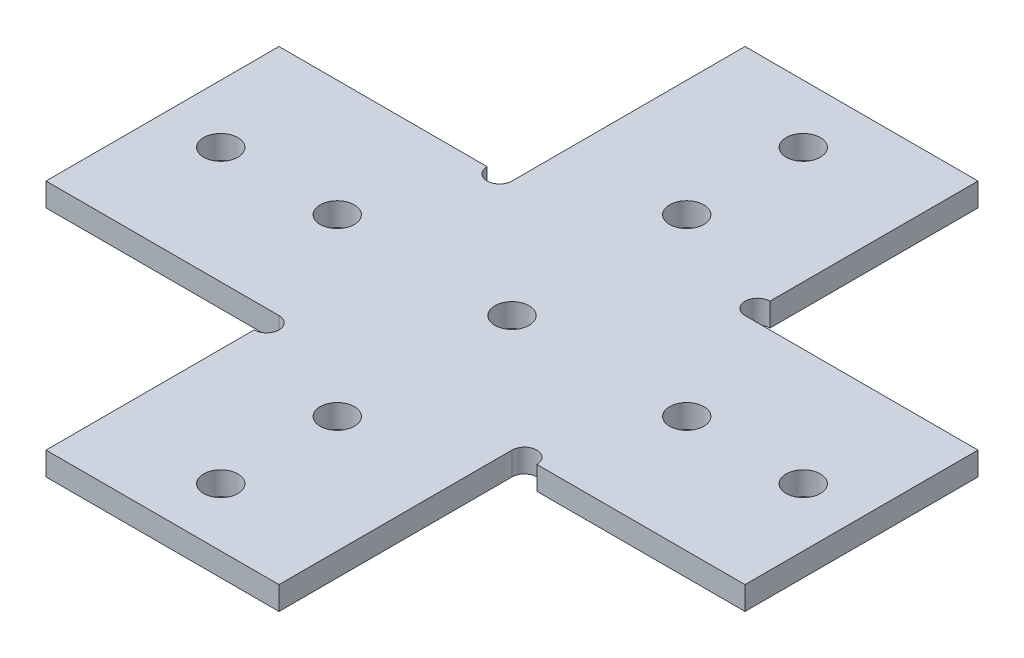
ISO-10303-21;
HEADER;
FILE_DESCRIPTION(('STEP AP214'),'2;1');
FILE_NAME('part.step','',(''),(''),'','','');
FILE_SCHEMA(('AUTOMOTIVE_DESIGN { 1 0 10303 214 1 1 1 1 }'));
ENDSEC;
DATA;
#1=APPLICATION_CONTEXT('core data for automotive mechanical design processes');
#2=APPLICATION_PROTOCOL_DEFINITION('international standard','automotive_design',2000,#1);
#3=PRODUCT_CONTEXT('',#1,'mechanical');
#4=PRODUCT('Part','Part','',(#3));
#5=PRODUCT_RELATED_PRODUCT_CATEGORY('part','',(#4));
#6=PRODUCT_DEFINITION_FORMATION('','',#4);
#7=PRODUCT_DEFINITION_CONTEXT('part definition',#1,'design');
#8=PRODUCT_DEFINITION('design','',#6,#7);
#9=PRODUCT_DEFINITION_SHAPE('','',#8);
#10=(LENGTH_UNIT() NAMED_UNIT(*) SI_UNIT(.MILLI.,.METRE.));
#11=(NAMED_UNIT(*) PLANE_ANGLE_UNIT() SI_UNIT($,.RADIAN.));
#12=(NAMED_UNIT(*) SI_UNIT($,.STERADIAN.) SOLID_ANGLE_UNIT());
#13=UNCERTAINTY_MEASURE_WITH_UNIT(LENGTH_MEASURE(1.E-05),#10,'distance_accuracy_value','');
#14=(GEOMETRIC_REPRESENTATION_CONTEXT(3) GLOBAL_UNCERTAINTY_ASSIGNED_CONTEXT((#13)) GLOBAL_UNIT_ASSIGNED_CONTEXT((#10,
#11,#12)) REPRESENTATION_CONTEXT('',''));
#15=CARTESIAN_POINT('',(0.,0.,0.));
#16=DIRECTION('',(0.,0.,1.));
#17=DIRECTION('',(1.,0.,0.));
#18=AXIS2_PLACEMENT_3D('',#15,#16,#17);
#19=CARTESIAN_POINT('',(-15.,-1.,16.6));
#20=DIRECTION('',(0.,1.,0.));
#21=DIRECTION('',(0.,0.,1.));
#22=AXIS2_PLACEMENT_3D('',#19,#20,#21);
#23=CYLINDRICAL_SURFACE('',#22,1.6);
#24=DIRECTION('',(0.,1.,0.));
#25=VECTOR('',#24,1.);
#26=CARTESIAN_POINT('',(-15.,-1.,18.2));
#27=LINE('',#26,#25);
#28=CARTESIAN_POINT('',(-15.,0.,18.2));
#29=VERTEX_POINT('',#28);
#30=CARTESIAN_POINT('',(-15.,3.,18.2));
#31=VERTEX_POINT('',#30);
#32=EDGE_CURVE('E177',#29,#31,#27,.T.);
#33=ORIENTED_EDGE('',*,*,#32,.T.);
#34=CARTESIAN_POINT('',(-15.,3.,16.6));
#35=DIRECTION('',(0.,1.,0.));
#36=DIRECTION('',(0.,0.,1.));
#37=AXIS2_PLACEMENT_3D('',#34,#35,#36);
#38=CIRCLE('',#37,1.6);
#39=CARTESIAN_POINT('',(-15.,3.,15.));
#40=VERTEX_POINT('',#39);
#41=EDGE_CURVE('E171',#31,#40,#38,.T.);
#42=ORIENTED_EDGE('',*,*,#41,.T.);
#43=DIRECTION('',(0.,-1.,0.));
#44=VECTOR('',#43,1.);
#45=CARTESIAN_POINT('',(-15.,3.,15.));
#46=LINE('',#45,#44);
#47=CARTESIAN_POINT('',(-15.,0.,15.));
#48=VERTEX_POINT('',#47);
#49=EDGE_CURVE('E174',#40,#48,#46,.T.);
#50=ORIENTED_EDGE('',*,*,#49,.T.);
#51=CARTESIAN_POINT('',(-15.,0.,16.6));
#52=DIRECTION('',(0.,1.,0.));
#53=DIRECTION('',(0.,0.,1.));
#54=AXIS2_PLACEMENT_3D('',#51,#52,#53);
#55=CIRCLE('',#54,1.6);
#56=EDGE_CURVE('E11',#29,#48,#55,.T.);
#57=ORIENTED_EDGE('',*,*,#56,.F.);
#58=EDGE_LOOP('',(#33,#42,#50,#57));
#59=FACE_BOUND('',#58,.T.);
#60=ADVANCED_FACE('F17',(#59),#23,.F.);
#61=CARTESIAN_POINT('',(16.6,-1.,15.));
#62=DIRECTION('',(0.,1.,0.));
#63=DIRECTION('',(0.,0.,1.));
#64=AXIS2_PLACEMENT_3D('',#61,#62,#63);
#65=CYLINDRICAL_SURFACE('',#64,1.6);
#66=CARTESIAN_POINT('',(16.6,0.,15.));
#67=DIRECTION('',(0.,1.,0.));
#68=DIRECTION('',(0.,0.,1.));
#69=AXIS2_PLACEMENT_3D('',#66,#67,#68);
#70=CIRCLE('',#69,1.6);
#71=CARTESIAN_POINT('',(18.2,0.,15.));
#72=VERTEX_POINT('',#71);
#73=CARTESIAN_POINT('',(15.,0.,15.));
#74=VERTEX_POINT('',#73);
#75=EDGE_CURVE('E25',#72,#74,#70,.T.);
#76=ORIENTED_EDGE('',*,*,#75,.F.);
#77=DIRECTION('',(0.,-1.,0.));
#78=VECTOR('',#77,1.);
#79=CARTESIAN_POINT('',(18.2,-1.,15.));
#80=LINE('',#79,#78);
#81=CARTESIAN_POINT('',(18.2,3.,15.));
#82=VERTEX_POINT('',#81);
#83=EDGE_CURVE('E242',#82,#72,#80,.T.);
#84=ORIENTED_EDGE('',*,*,#83,.F.);
#85=CARTESIAN_POINT('',(16.6,3.,15.));
#86=DIRECTION('',(0.,1.,0.));
#87=DIRECTION('',(0.,0.,1.));
#88=AXIS2_PLACEMENT_3D('',#85,#86,#87);
#89=CIRCLE('',#88,1.6);
#90=CARTESIAN_POINT('',(15.,3.,15.));
#91=VERTEX_POINT('',#90);
#92=EDGE_CURVE('E182',#82,#91,#89,.T.);
#93=ORIENTED_EDGE('',*,*,#92,.T.);
#94=DIRECTION('',(0.,-1.,0.));
#95=VECTOR('',#94,1.);
#96=CARTESIAN_POINT('',(15.,3.,15.));
#97=LINE('',#96,#95);
#98=EDGE_CURVE('E237',#91,#74,#97,.T.);
#99=ORIENTED_EDGE('',*,*,#98,.T.);
#100=EDGE_LOOP('',(#76,#84,#93,#99));
#101=FACE_BOUND('',#100,.T.);
#102=ADVANCED_FACE('F297',(#101),#65,.F.);
#103=CARTESIAN_POINT('',(15.,-1.,-16.6));
#104=DIRECTION('',(0.,1.,0.));
#105=DIRECTION('',(0.,0.,1.));
#106=AXIS2_PLACEMENT_3D('',#103,#104,#105);
#107=CYLINDRICAL_SURFACE('',#106,1.6);
#108=CARTESIAN_POINT('',(15.,0.,-16.6));
#109=DIRECTION('',(0.,1.,0.));
#110=DIRECTION('',(0.,0.,1.));
#111=AXIS2_PLACEMENT_3D('',#108,#109,#110);
#112=CIRCLE('',#111,1.6);
#113=CARTESIAN_POINT('',(15.,0.,-18.2));
#114=VERTEX_POINT('',#113);
#115=CARTESIAN_POINT('',(15.,0.,-15.));
#116=VERTEX_POINT('',#115);
#117=EDGE_CURVE('E49',#114,#116,#112,.T.);
#118=ORIENTED_EDGE('',*,*,#117,.F.);
#119=DIRECTION('',(0.,-1.,0.));
#120=VECTOR('',#119,1.);
#121=CARTESIAN_POINT('',(15.,-1.,-18.2));
#122=LINE('',#121,#120);
#123=CARTESIAN_POINT('',(15.,3.,-18.2));
#124=VERTEX_POINT('',#123);
#125=EDGE_CURVE('E274',#124,#114,#122,.T.);
#126=ORIENTED_EDGE('',*,*,#125,.F.);
#127=CARTESIAN_POINT('',(15.,3.,-16.6));
#128=DIRECTION('',(0.,1.,0.));
#129=DIRECTION('',(0.,0.,1.));
#130=AXIS2_PLACEMENT_3D('',#127,#128,#129);
#131=CIRCLE('',#130,1.6);
#132=CARTESIAN_POINT('',(15.,3.,-15.));
#133=VERTEX_POINT('',#132);
#134=EDGE_CURVE('E233',#124,#133,#131,.T.);
#135=ORIENTED_EDGE('',*,*,#134,.T.);
#136=DIRECTION('',(0.,-1.,0.));
#137=VECTOR('',#136,1.);
#138=CARTESIAN_POINT('',(15.,3.,-15.));
#139=LINE('',#138,#137);
#140=EDGE_CURVE('E263',#133,#116,#139,.T.);
#141=ORIENTED_EDGE('',*,*,#140,.T.);
#142=EDGE_LOOP('',(#118,#126,#135,#141));
#143=FACE_BOUND('',#142,.T.);
#144=ADVANCED_FACE('F379',(#143),#107,.F.);
#145=CARTESIAN_POINT('',(0.,0.,0.));
#146=DIRECTION('',(0.,1.,0.));
#147=DIRECTION('',(1.,0.,0.));
#148=AXIS2_PLACEMENT_3D('',#145,#146,#147);
#149=PLANE('',#148);
#150=CARTESIAN_POINT('',(0.,0.,22.5));
#151=DIRECTION('',(0.,1.,0.));
#152=DIRECTION('',(0.,0.,1.));
#153=AXIS2_PLACEMENT_3D('',#150,#151,#152);
#154=CIRCLE('',#153,2.2);
#155=CARTESIAN_POINT('',(0.,0.,24.7));
#156=VERTEX_POINT('',#155);
#157=EDGE_CURVE('E428',#156,#156,#154,.T.);
#158=ORIENTED_EDGE('',*,*,#157,.T.);
#159=EDGE_LOOP('',(#158));
#160=FACE_BOUND('',#159,.T.);
#161=CARTESIAN_POINT('',(0.,0.,37.5));
#162=DIRECTION('',(0.,1.,0.));
#163=DIRECTION('',(0.,0.,1.));
#164=AXIS2_PLACEMENT_3D('',#161,#162,#163);
#165=CIRCLE('',#164,2.2);
#166=CARTESIAN_POINT('',(0.,0.,39.7));
#167=VERTEX_POINT('',#166);
#168=EDGE_CURVE('E332',#167,#167,#165,.T.);
#169=ORIENTED_EDGE('',*,*,#168,.T.);
#170=EDGE_LOOP('',(#169));
#171=FACE_BOUND('',#170,.T.);
#172=CARTESIAN_POINT('',(37.5,0.,0.));
#173=DIRECTION('',(0.,-1.,0.));
#174=DIRECTION('',(0.,0.,1.));
#175=AXIS2_PLACEMENT_3D('',#172,#173,#174);
#176=CIRCLE('',#175,2.2);
#177=CARTESIAN_POINT('',(37.5,0.,2.2));
#178=VERTEX_POINT('',#177);
#179=EDGE_CURVE('E323',#178,#178,#176,.T.);
#180=ORIENTED_EDGE('',*,*,#179,.F.);
#181=EDGE_LOOP('',(#180));
#182=FACE_BOUND('',#181,.T.);
#183=CARTESIAN_POINT('',(22.5,0.,0.));
#184=DIRECTION('',(0.,-1.,0.));
#185=DIRECTION('',(0.,0.,1.));
#186=AXIS2_PLACEMENT_3D('',#183,#184,#185);
#187=CIRCLE('',#186,2.2);
#188=CARTESIAN_POINT('',(22.5,0.,2.2));
#189=VERTEX_POINT('',#188);
#190=EDGE_CURVE('E324',#189,#189,#187,.T.);
#191=ORIENTED_EDGE('',*,*,#190,.F.);
#192=EDGE_LOOP('',(#191));
#193=FACE_BOUND('',#192,.T.);
#194=CARTESIAN_POINT('',(-22.5,0.,0.));
#195=DIRECTION('',(0.,1.,0.));
#196=DIRECTION('',(0.,0.,1.));
#197=AXIS2_PLACEMENT_3D('',#194,#195,#196);
#198=CIRCLE('',#197,2.2);
#199=CARTESIAN_POINT('',(-22.5,0.,2.2));
#200=VERTEX_POINT('',#199);
#201=EDGE_CURVE('E462',#200,#200,#198,.T.);
#202=ORIENTED_EDGE('',*,*,#201,.T.);
#203=EDGE_LOOP('',(#202));
#204=FACE_BOUND('',#203,.T.);
#205=CARTESIAN_POINT('',(-37.5,0.,0.));
#206=DIRECTION('',(0.,1.,0.));
#207=DIRECTION('',(0.,0.,1.));
#208=AXIS2_PLACEMENT_3D('',#205,#206,#207);
#209=CIRCLE('',#208,2.2);
#210=CARTESIAN_POINT('',(-37.5,0.,2.2));
#211=VERTEX_POINT('',#210);
#212=EDGE_CURVE('E452',#211,#211,#209,.T.);
#213=ORIENTED_EDGE('',*,*,#212,.T.);
#214=EDGE_LOOP('',(#213));
#215=FACE_BOUND('',#214,.T.);
#216=CARTESIAN_POINT('',(0.,0.,0.));
#217=DIRECTION('',(0.,1.,0.));
#218=DIRECTION('',(0.,0.,1.));
#219=AXIS2_PLACEMENT_3D('',#216,#217,#218);
#220=CIRCLE('',#219,2.2);
#221=CARTESIAN_POINT('',(0.,0.,2.2));
#222=VERTEX_POINT('',#221);
#223=EDGE_CURVE('E439',#222,#222,#220,.T.);
#224=ORIENTED_EDGE('',*,*,#223,.T.);
#225=EDGE_LOOP('',(#224));
#226=FACE_BOUND('',#225,.T.);
#227=CARTESIAN_POINT('',(0.,0.,-22.5));
#228=DIRECTION('',(0.,-1.,0.));
#229=DIRECTION('',(0.,0.,1.));
#230=AXIS2_PLACEMENT_3D('',#227,#228,#229);
#231=CIRCLE('',#230,2.2);
#232=CARTESIAN_POINT('',(0.,0.,-20.3));
#233=VERTEX_POINT('',#232);
#234=EDGE_CURVE('E420',#233,#233,#231,.T.);
#235=ORIENTED_EDGE('',*,*,#234,.F.);
#236=EDGE_LOOP('',(#235));
#237=FACE_BOUND('',#236,.T.);
#238=CARTESIAN_POINT('',(0.,0.,-37.5));
#239=DIRECTION('',(0.,-1.,0.));
#240=DIRECTION('',(0.,0.,1.));
#241=AXIS2_PLACEMENT_3D('',#238,#239,#240);
#242=CIRCLE('',#241,2.2);
#243=CARTESIAN_POINT('',(0.,0.,-35.3));
#244=VERTEX_POINT('',#243);
#245=EDGE_CURVE('E435',#244,#244,#242,.T.);
#246=ORIENTED_EDGE('',*,*,#245,.F.);
#247=EDGE_LOOP('',(#246));
#248=FACE_BOUND('',#247,.T.);
#249=DIRECTION('',(1.,0.,0.));
#250=VECTOR('',#249,1.);
#251=CARTESIAN_POINT('',(0.,0.,-15.));
#252=LINE('',#251,#250);
#253=CARTESIAN_POINT('',(-45.,0.,-15.));
#254=VERTEX_POINT('',#253);
#255=CARTESIAN_POINT('',(-18.2,0.,-15.));
#256=VERTEX_POINT('',#255);
#257=EDGE_CURVE('E349',#254,#256,#252,.T.);
#258=ORIENTED_EDGE('',*,*,#257,.T.);
#259=CARTESIAN_POINT('',(-16.6,0.,-15.));
#260=DIRECTION('',(0.,1.,0.));
#261=DIRECTION('',(0.,0.,1.));
#262=AXIS2_PLACEMENT_3D('',#259,#260,#261);
#263=CIRCLE('',#262,1.6);
#264=CARTESIAN_POINT('',(-15.,0.,-15.));
#265=VERTEX_POINT('',#264);
#266=EDGE_CURVE('E403',#256,#265,#263,.T.);
#267=ORIENTED_EDGE('',*,*,#266,.T.);
#268=DIRECTION('',(0.,0.,-1.));
#269=VECTOR('',#268,1.);
#270=CARTESIAN_POINT('',(-15.,0.,0.));
#271=LINE('',#270,#269);
#272=CARTESIAN_POINT('',(-15.,0.,-45.));
#273=VERTEX_POINT('',#272);
#274=EDGE_CURVE('E336',#265,#273,#271,.T.);
#275=ORIENTED_EDGE('',*,*,#274,.T.);
#276=DIRECTION('',(1.,0.,0.));
#277=VECTOR('',#276,1.);
#278=CARTESIAN_POINT('',(0.,0.,-45.));
#279=LINE('',#278,#277);
#280=CARTESIAN_POINT('',(15.,0.,-45.));
#281=VERTEX_POINT('',#280);
#282=EDGE_CURVE('E38',#273,#281,#279,.T.);
#283=ORIENTED_EDGE('',*,*,#282,.T.);
#284=DIRECTION('',(0.,0.,-1.));
#285=VECTOR('',#284,1.);
#286=CARTESIAN_POINT('',(15.,0.,0.));
#287=LINE('',#286,#285);
#288=EDGE_CURVE('E275',#114,#281,#287,.T.);
#289=ORIENTED_EDGE('',*,*,#288,.F.);
#290=ORIENTED_EDGE('',*,*,#117,.T.);
#291=DIRECTION('',(1.,0.,0.));
#292=VECTOR('',#291,1.);
#293=CARTESIAN_POINT('',(0.,0.,-15.));
#294=LINE('',#293,#292);
#295=CARTESIAN_POINT('',(45.,0.,-15.));
#296=VERTEX_POINT('',#295);
#297=EDGE_CURVE('E260',#116,#296,#294,.T.);
#298=ORIENTED_EDGE('',*,*,#297,.T.);
#299=DIRECTION('',(0.,0.,-1.));
#300=VECTOR('',#299,1.);
#301=CARTESIAN_POINT('',(45.,0.,0.));
#302=LINE('',#301,#300);
#303=CARTESIAN_POINT('',(45.,0.,15.));
#304=VERTEX_POINT('',#303);
#305=EDGE_CURVE('E247',#304,#296,#302,.T.);
#306=ORIENTED_EDGE('',*,*,#305,.F.);
#307=DIRECTION('',(1.,0.,0.));
#308=VECTOR('',#307,1.);
#309=CARTESIAN_POINT('',(0.,0.,15.));
#310=LINE('',#309,#308);
#311=EDGE_CURVE('E205',#72,#304,#310,.T.);
#312=ORIENTED_EDGE('',*,*,#311,.F.);
#313=ORIENTED_EDGE('',*,*,#75,.T.);
#314=DIRECTION('',(0.,0.,-1.));
#315=VECTOR('',#314,1.);
#316=CARTESIAN_POINT('',(15.,0.,0.));
#317=LINE('',#316,#315);
#318=CARTESIAN_POINT('',(15.,0.,45.));
#319=VERTEX_POINT('',#318);
#320=EDGE_CURVE('E230',#319,#74,#317,.T.);
#321=ORIENTED_EDGE('',*,*,#320,.F.);
#322=DIRECTION('',(1.,0.,0.));
#323=VECTOR('',#322,1.);
#324=CARTESIAN_POINT('',(0.,0.,45.));
#325=LINE('',#324,#323);
#326=CARTESIAN_POINT('',(-15.,0.,45.));
#327=VERTEX_POINT('',#326);
#328=EDGE_CURVE('E215',#327,#319,#325,.T.);
#329=ORIENTED_EDGE('',*,*,#328,.F.);
#330=DIRECTION('',(0.,0.,-1.));
#331=VECTOR('',#330,1.);
#332=CARTESIAN_POINT('',(-15.,0.,0.));
#333=LINE('',#332,#331);
#334=EDGE_CURVE('E210',#327,#29,#333,.T.);
#335=ORIENTED_EDGE('',*,*,#334,.T.);
#336=ORIENTED_EDGE('',*,*,#56,.T.);
#337=DIRECTION('',(1.,0.,0.));
#338=VECTOR('',#337,1.);
#339=CARTESIAN_POINT('',(0.,0.,15.));
#340=LINE('',#339,#338);
#341=CARTESIAN_POINT('',(-45.,0.,15.));
#342=VERTEX_POINT('',#341);
#343=EDGE_CURVE('E196',#342,#48,#340,.T.);
#344=ORIENTED_EDGE('',*,*,#343,.F.);
#345=DIRECTION('',(0.,0.,-1.));
#346=VECTOR('',#345,1.);
#347=CARTESIAN_POINT('',(-45.,0.,0.));
#348=LINE('',#347,#346);
#349=EDGE_CURVE('E352',#342,#254,#348,.T.);
#350=ORIENTED_EDGE('',*,*,#349,.T.);
#351=EDGE_LOOP('',(#258,#267,#275,#283,#289,#290,#298,#306,#312,#313,#321,#329,#335,#336,#344,#350));
#352=FACE_BOUND('',#351,.T.);
#353=ADVANCED_FACE('F291',(#160,#171,#182,#193,#204,#215,#226,#237,#248,#352),#149,.F.);
#354=CARTESIAN_POINT('',(0.,3.,0.));
#355=DIRECTION('',(0.,1.,0.));
#356=DIRECTION('',(1.,0.,0.));
#357=AXIS2_PLACEMENT_3D('',#354,#355,#356);
#358=PLANE('',#357);
#359=CARTESIAN_POINT('',(0.,3.,22.5));
#360=DIRECTION('',(0.,1.,0.));
#361=DIRECTION('',(0.,0.,1.));
#362=AXIS2_PLACEMENT_3D('',#359,#360,#361);
#363=CIRCLE('',#362,2.2);
#364=CARTESIAN_POINT('',(0.,3.,24.7));
#365=VERTEX_POINT('',#364);
#366=EDGE_CURVE('E419',#365,#365,#363,.T.);
#367=ORIENTED_EDGE('',*,*,#366,.F.);
#368=EDGE_LOOP('',(#367));
#369=FACE_BOUND('',#368,.T.);
#370=CARTESIAN_POINT('',(0.,3.,37.5));
#371=DIRECTION('',(0.,1.,0.));
#372=DIRECTION('',(0.,0.,1.));
#373=AXIS2_PLACEMENT_3D('',#370,#371,#372);
#374=CIRCLE('',#373,2.2);
#375=CARTESIAN_POINT('',(0.,3.,39.7));
#376=VERTEX_POINT('',#375);
#377=EDGE_CURVE('E328',#376,#376,#374,.T.);
#378=ORIENTED_EDGE('',*,*,#377,.F.);
#379=EDGE_LOOP('',(#378));
#380=FACE_BOUND('',#379,.T.);
#381=CARTESIAN_POINT('',(37.5,3.,0.));
#382=DIRECTION('',(0.,-1.,0.));
#383=DIRECTION('',(0.,0.,1.));
#384=AXIS2_PLACEMENT_3D('',#381,#382,#383);
#385=CIRCLE('',#384,2.2);
#386=CARTESIAN_POINT('',(37.5,3.,2.2));
#387=VERTEX_POINT('',#386);
#388=EDGE_CURVE('E319',#387,#387,#385,.T.);
#389=ORIENTED_EDGE('',*,*,#388,.T.);
#390=EDGE_LOOP('',(#389));
#391=FACE_BOUND('',#390,.T.);
#392=CARTESIAN_POINT('',(22.5,3.,0.));
#393=DIRECTION('',(0.,-1.,0.));
#394=DIRECTION('',(0.,0.,1.));
#395=AXIS2_PLACEMENT_3D('',#392,#393,#394);
#396=CIRCLE('',#395,2.2);
#397=CARTESIAN_POINT('',(22.5,3.,2.2));
#398=VERTEX_POINT('',#397);
#399=EDGE_CURVE('E448',#398,#398,#396,.T.);
#400=ORIENTED_EDGE('',*,*,#399,.T.);
#401=EDGE_LOOP('',(#400));
#402=FACE_BOUND('',#401,.T.);
#403=CARTESIAN_POINT('',(-22.5,3.,0.));
#404=DIRECTION('',(0.,1.,0.));
#405=DIRECTION('',(0.,0.,1.));
#406=AXIS2_PLACEMENT_3D('',#403,#404,#405);
#407=CIRCLE('',#406,2.2);
#408=CARTESIAN_POINT('',(-22.5,3.,2.2));
#409=VERTEX_POINT('',#408);
#410=EDGE_CURVE('E458',#409,#409,#407,.T.);
#411=ORIENTED_EDGE('',*,*,#410,.F.);
#412=EDGE_LOOP('',(#411));
#413=FACE_BOUND('',#412,.T.);
#414=CARTESIAN_POINT('',(-37.5,3.,0.));
#415=DIRECTION('',(0.,1.,0.));
#416=DIRECTION('',(0.,0.,1.));
#417=AXIS2_PLACEMENT_3D('',#414,#415,#416);
#418=CIRCLE('',#417,2.2);
#419=CARTESIAN_POINT('',(-37.5,3.,2.2));
#420=VERTEX_POINT('',#419);
#421=EDGE_CURVE('E444',#420,#420,#418,.T.);
#422=ORIENTED_EDGE('',*,*,#421,.F.);
#423=EDGE_LOOP('',(#422));
#424=FACE_BOUND('',#423,.T.);
#425=CARTESIAN_POINT('',(0.,3.,0.));
#426=DIRECTION('',(0.,1.,0.));
#427=DIRECTION('',(0.,0.,1.));
#428=AXIS2_PLACEMENT_3D('',#425,#426,#427);
#429=CIRCLE('',#428,2.2);
#430=CARTESIAN_POINT('',(0.,3.,2.2));
#431=VERTEX_POINT('',#430);
#432=EDGE_CURVE('E424',#431,#431,#429,.T.);
#433=ORIENTED_EDGE('',*,*,#432,.F.);
#434=EDGE_LOOP('',(#433));
#435=FACE_BOUND('',#434,.T.);
#436=CARTESIAN_POINT('',(0.,3.,-22.5));
#437=DIRECTION('',(0.,-1.,0.));
#438=DIRECTION('',(0.,0.,1.));
#439=AXIS2_PLACEMENT_3D('',#436,#437,#438);
#440=CIRCLE('',#439,2.2);
#441=CARTESIAN_POINT('',(0.,3.,-20.3));
#442=VERTEX_POINT('',#441);
#443=EDGE_CURVE('E425',#442,#442,#440,.T.);
#444=ORIENTED_EDGE('',*,*,#443,.T.);
#445=EDGE_LOOP('',(#444));
#446=FACE_BOUND('',#445,.T.);
#447=CARTESIAN_POINT('',(0.,3.,-37.5));
#448=DIRECTION('',(0.,-1.,0.));
#449=DIRECTION('',(0.,0.,1.));
#450=AXIS2_PLACEMENT_3D('',#447,#448,#449);
#451=CIRCLE('',#450,2.2);
#452=CARTESIAN_POINT('',(0.,3.,-35.3));
#453=VERTEX_POINT('',#452);
#454=EDGE_CURVE('E432',#453,#453,#451,.T.);
#455=ORIENTED_EDGE('',*,*,#454,.T.);
#456=EDGE_LOOP('',(#455));
#457=FACE_BOUND('',#456,.T.);
#458=CARTESIAN_POINT('',(-16.6,3.,-15.));
#459=DIRECTION('',(0.,1.,0.));
#460=DIRECTION('',(0.,0.,1.));
#461=AXIS2_PLACEMENT_3D('',#458,#459,#460);
#462=CIRCLE('',#461,1.6);
#463=CARTESIAN_POINT('',(-18.2,3.,-15.));
#464=VERTEX_POINT('',#463);
#465=CARTESIAN_POINT('',(-15.,3.,-15.));
#466=VERTEX_POINT('',#465);
#467=EDGE_CURVE('E398',#464,#466,#462,.T.);
#468=ORIENTED_EDGE('',*,*,#467,.F.);
#469=DIRECTION('',(1.,0.,0.));
#470=VECTOR('',#469,1.);
#471=CARTESIAN_POINT('',(0.,3.,-15.));
#472=LINE('',#471,#470);
#473=CARTESIAN_POINT('',(-45.,3.,-15.));
#474=VERTEX_POINT('',#473);
#475=EDGE_CURVE('E348',#474,#464,#472,.T.);
#476=ORIENTED_EDGE('',*,*,#475,.F.);
#477=DIRECTION('',(0.,0.,-1.));
#478=VECTOR('',#477,1.);
#479=CARTESIAN_POINT('',(-45.,3.,0.));
#480=LINE('',#479,#478);
#481=CARTESIAN_POINT('',(-45.,3.,15.));
#482=VERTEX_POINT('',#481);
#483=EDGE_CURVE('E189',#482,#474,#480,.T.);
#484=ORIENTED_EDGE('',*,*,#483,.F.);
#485=DIRECTION('',(1.,0.,0.));
#486=VECTOR('',#485,1.);
#487=CARTESIAN_POINT('',(0.,3.,15.));
#488=LINE('',#487,#486);
#489=EDGE_CURVE('E186',#482,#40,#488,.T.);
#490=ORIENTED_EDGE('',*,*,#489,.T.);
#491=ORIENTED_EDGE('',*,*,#41,.F.);
#492=DIRECTION('',(0.,0.,-1.));
#493=VECTOR('',#492,1.);
#494=CARTESIAN_POINT('',(-15.,3.,0.));
#495=LINE('',#494,#493);
#496=CARTESIAN_POINT('',(-15.,3.,45.));
#497=VERTEX_POINT('',#496);
#498=EDGE_CURVE('E220',#497,#31,#495,.T.);
#499=ORIENTED_EDGE('',*,*,#498,.F.);
#500=DIRECTION('',(1.,0.,0.));
#501=VECTOR('',#500,1.);
#502=CARTESIAN_POINT('',(0.,3.,45.));
#503=LINE('',#502,#501);
#504=CARTESIAN_POINT('',(15.,3.,45.));
#505=VERTEX_POINT('',#504);
#506=EDGE_CURVE('E226',#497,#505,#503,.T.);
#507=ORIENTED_EDGE('',*,*,#506,.T.);
#508=DIRECTION('',(0.,0.,-1.));
#509=VECTOR('',#508,1.);
#510=CARTESIAN_POINT('',(15.,3.,0.));
#511=LINE('',#510,#509);
#512=EDGE_CURVE('E241',#505,#91,#511,.T.);
#513=ORIENTED_EDGE('',*,*,#512,.T.);
#514=ORIENTED_EDGE('',*,*,#92,.F.);
#515=DIRECTION('',(1.,0.,0.));
#516=VECTOR('',#515,1.);
#517=CARTESIAN_POINT('',(0.,3.,15.));
#518=LINE('',#517,#516);
#519=CARTESIAN_POINT('',(45.,3.,15.));
#520=VERTEX_POINT('',#519);
#521=EDGE_CURVE('E246',#82,#520,#518,.T.);
#522=ORIENTED_EDGE('',*,*,#521,.T.);
#523=DIRECTION('',(0.,0.,-1.));
#524=VECTOR('',#523,1.);
#525=CARTESIAN_POINT('',(45.,3.,0.));
#526=LINE('',#525,#524);
#527=CARTESIAN_POINT('',(45.,3.,-15.));
#528=VERTEX_POINT('',#527);
#529=EDGE_CURVE('E256',#520,#528,#526,.T.);
#530=ORIENTED_EDGE('',*,*,#529,.T.);
#531=DIRECTION('',(1.,0.,0.));
#532=VECTOR('',#531,1.);
#533=CARTESIAN_POINT('',(0.,3.,-15.));
#534=LINE('',#533,#532);
#535=EDGE_CURVE('E266',#133,#528,#534,.T.);
#536=ORIENTED_EDGE('',*,*,#535,.F.);
#537=ORIENTED_EDGE('',*,*,#134,.F.);
#538=DIRECTION('',(0.,0.,-1.));
#539=VECTOR('',#538,1.);
#540=CARTESIAN_POINT('',(15.,3.,0.));
#541=LINE('',#540,#539);
#542=CARTESIAN_POINT('',(15.,3.,-45.));
#543=VERTEX_POINT('',#542);
#544=EDGE_CURVE('E270',#124,#543,#541,.T.);
#545=ORIENTED_EDGE('',*,*,#544,.T.);
#546=DIRECTION('',(1.,0.,0.));
#547=VECTOR('',#546,1.);
#548=CARTESIAN_POINT('',(0.,3.,-45.));
#549=LINE('',#548,#547);
#550=CARTESIAN_POINT('',(-15.,3.,-45.));
#551=VERTEX_POINT('',#550);
#552=EDGE_CURVE('E183',#551,#543,#549,.T.);
#553=ORIENTED_EDGE('',*,*,#552,.F.);
#554=DIRECTION('',(0.,0.,-1.));
#555=VECTOR('',#554,1.);
#556=CARTESIAN_POINT('',(-15.,3.,0.));
#557=LINE('',#556,#555);
#558=EDGE_CURVE('E339',#466,#551,#557,.T.);
#559=ORIENTED_EDGE('',*,*,#558,.F.);
#560=EDGE_LOOP('',(#468,#476,#484,#490,#491,#499,#507,#513,#514,#522,#530,#536,#537,#545,#553,#559));
#561=FACE_BOUND('',#560,.T.);
#562=ADVANCED_FACE('F187',(#369,#380,#391,#402,#413,#424,#435,#446,#457,#561),#358,.T.);
#563=CARTESIAN_POINT('',(0.,3.,-45.));
#564=DIRECTION('',(0.,0.,-1.));
#565=DIRECTION('',(0.,-1.,0.));
#566=AXIS2_PLACEMENT_3D('',#563,#564,#565);
#567=PLANE('',#566);
#568=ORIENTED_EDGE('',*,*,#282,.F.);
#569=DIRECTION('',(0.,-1.,0.));
#570=VECTOR('',#569,1.);
#571=CARTESIAN_POINT('',(-15.,3.,-45.));
#572=LINE('',#571,#570);
#573=EDGE_CURVE('E343',#551,#273,#572,.T.);
#574=ORIENTED_EDGE('',*,*,#573,.F.);
#575=ORIENTED_EDGE('',*,*,#552,.T.);
#576=DIRECTION('',(0.,-1.,0.));
#577=VECTOR('',#576,1.);
#578=CARTESIAN_POINT('',(15.,3.,-45.));
#579=LINE('',#578,#577);
#580=EDGE_CURVE('E269',#543,#281,#579,.T.);
#581=ORIENTED_EDGE('',*,*,#580,.T.);
#582=EDGE_LOOP('',(#568,#574,#575,#581));
#583=FACE_BOUND('',#582,.T.);
#584=ADVANCED_FACE('F387',(#583),#567,.T.);
#585=CARTESIAN_POINT('',(15.,3.,0.));
#586=DIRECTION('',(-1.,0.,0.));
#587=DIRECTION('',(0.,0.,1.));
#588=AXIS2_PLACEMENT_3D('',#585,#586,#587);
#589=PLANE('',#588);
#590=ORIENTED_EDGE('',*,*,#544,.F.);
#591=ORIENTED_EDGE('',*,*,#125,.T.);
#592=ORIENTED_EDGE('',*,*,#288,.T.);
#593=ORIENTED_EDGE('',*,*,#580,.F.);
#594=EDGE_LOOP('',(#590,#591,#592,#593));
#595=FACE_BOUND('',#594,.T.);
#596=ADVANCED_FACE('F385',(#595),#589,.F.);
#597=CARTESIAN_POINT('',(0.,3.,-15.));
#598=DIRECTION('',(0.,0.,-1.));
#599=DIRECTION('',(0.,-1.,0.));
#600=AXIS2_PLACEMENT_3D('',#597,#598,#599);
#601=PLANE('',#600);
#602=ORIENTED_EDGE('',*,*,#297,.F.);
#603=ORIENTED_EDGE('',*,*,#140,.F.);
#604=ORIENTED_EDGE('',*,*,#535,.T.);
#605=DIRECTION('',(0.,-1.,0.));
#606=VECTOR('',#605,1.);
#607=CARTESIAN_POINT('',(45.,3.,-15.));
#608=LINE('',#607,#606);
#609=EDGE_CURVE('E251',#528,#296,#608,.T.);
#610=ORIENTED_EDGE('',*,*,#609,.T.);
#611=EDGE_LOOP('',(#602,#603,#604,#610));
#612=FACE_BOUND('',#611,.T.);
#613=ADVANCED_FACE('F378',(#612),#601,.T.);
#614=CARTESIAN_POINT('',(45.,3.,0.));
#615=DIRECTION('',(-1.,0.,0.));
#616=DIRECTION('',(0.,0.,1.));
#617=AXIS2_PLACEMENT_3D('',#614,#615,#616);
#618=PLANE('',#617);
#619=ORIENTED_EDGE('',*,*,#305,.T.);
#620=ORIENTED_EDGE('',*,*,#609,.F.);
#621=ORIENTED_EDGE('',*,*,#529,.F.);
#622=DIRECTION('',(0.,-1.,0.));
#623=VECTOR('',#622,1.);
#624=CARTESIAN_POINT('',(45.,3.,15.));
#625=LINE('',#624,#623);
#626=EDGE_CURVE('E252',#520,#304,#625,.T.);
#627=ORIENTED_EDGE('',*,*,#626,.T.);
#628=EDGE_LOOP('',(#619,#620,#621,#627));
#629=FACE_BOUND('',#628,.T.);
#630=ADVANCED_FACE('F375',(#629),#618,.F.);
#631=CARTESIAN_POINT('',(0.,3.,15.));
#632=DIRECTION('',(0.,0.,-1.));
#633=DIRECTION('',(0.,-1.,0.));
#634=AXIS2_PLACEMENT_3D('',#631,#632,#633);
#635=PLANE('',#634);
#636=ORIENTED_EDGE('',*,*,#521,.F.);
#637=ORIENTED_EDGE('',*,*,#83,.T.);
#638=ORIENTED_EDGE('',*,*,#311,.T.);
#639=ORIENTED_EDGE('',*,*,#626,.F.);
#640=EDGE_LOOP('',(#636,#637,#638,#639));
#641=FACE_BOUND('',#640,.T.);
#642=ADVANCED_FACE('F371',(#641),#635,.F.);
#643=CARTESIAN_POINT('',(15.,3.,0.));
#644=DIRECTION('',(-1.,0.,0.));
#645=DIRECTION('',(0.,0.,1.));
#646=AXIS2_PLACEMENT_3D('',#643,#644,#645);
#647=PLANE('',#646);
#648=ORIENTED_EDGE('',*,*,#320,.T.);
#649=ORIENTED_EDGE('',*,*,#98,.F.);
#650=ORIENTED_EDGE('',*,*,#512,.F.);
#651=DIRECTION('',(0.,-1.,0.));
#652=VECTOR('',#651,1.);
#653=CARTESIAN_POINT('',(15.,3.,45.));
#654=LINE('',#653,#652);
#655=EDGE_CURVE('E219',#505,#319,#654,.T.);
#656=ORIENTED_EDGE('',*,*,#655,.T.);
#657=EDGE_LOOP('',(#648,#649,#650,#656));
#658=FACE_BOUND('',#657,.T.);
#659=ADVANCED_FACE('F300',(#658),#647,.F.);
#660=CARTESIAN_POINT('',(0.,3.,45.));
#661=DIRECTION('',(0.,0.,-1.));
#662=DIRECTION('',(0.,-1.,0.));
#663=AXIS2_PLACEMENT_3D('',#660,#661,#662);
#664=PLANE('',#663);
#665=ORIENTED_EDGE('',*,*,#328,.T.);
#666=ORIENTED_EDGE('',*,*,#655,.F.);
#667=ORIENTED_EDGE('',*,*,#506,.F.);
#668=DIRECTION('',(0.,-1.,0.));
#669=VECTOR('',#668,1.);
#670=CARTESIAN_POINT('',(-15.,3.,45.));
#671=LINE('',#670,#669);
#672=EDGE_CURVE('E214',#497,#327,#671,.T.);
#673=ORIENTED_EDGE('',*,*,#672,.T.);
#674=EDGE_LOOP('',(#665,#666,#667,#673));
#675=FACE_BOUND('',#674,.T.);
#676=ADVANCED_FACE('F305',(#675),#664,.F.);
#677=CARTESIAN_POINT('',(-15.,3.,0.));
#678=DIRECTION('',(-1.,0.,0.));
#679=DIRECTION('',(0.,0.,1.));
#680=AXIS2_PLACEMENT_3D('',#677,#678,#679);
#681=PLANE('',#680);
#682=ORIENTED_EDGE('',*,*,#32,.F.);
#683=ORIENTED_EDGE('',*,*,#334,.F.);
#684=ORIENTED_EDGE('',*,*,#672,.F.);
#685=ORIENTED_EDGE('',*,*,#498,.T.);
#686=EDGE_LOOP('',(#682,#683,#684,#685));
#687=FACE_BOUND('',#686,.T.);
#688=ADVANCED_FACE('F309',(#687),#681,.T.);
#689=CARTESIAN_POINT('',(0.,3.,15.));
#690=DIRECTION('',(0.,0.,-1.));
#691=DIRECTION('',(0.,-1.,0.));
#692=AXIS2_PLACEMENT_3D('',#689,#690,#691);
#693=PLANE('',#692);
#694=ORIENTED_EDGE('',*,*,#343,.T.);
#695=ORIENTED_EDGE('',*,*,#49,.F.);
#696=ORIENTED_EDGE('',*,*,#489,.F.);
#697=DIRECTION('',(0.,-1.,0.));
#698=VECTOR('',#697,1.);
#699=CARTESIAN_POINT('',(-45.,3.,15.));
#700=LINE('',#699,#698);
#701=EDGE_CURVE('E354',#482,#342,#700,.T.);
#702=ORIENTED_EDGE('',*,*,#701,.T.);
#703=EDGE_LOOP('',(#694,#695,#696,#702));
#704=FACE_BOUND('',#703,.T.);
#705=ADVANCED_FACE('F195',(#704),#693,.F.);
#706=CARTESIAN_POINT('',(-45.,3.,0.));
#707=DIRECTION('',(-1.,0.,0.));
#708=DIRECTION('',(0.,0.,1.));
#709=AXIS2_PLACEMENT_3D('',#706,#707,#708);
#710=PLANE('',#709);
#711=ORIENTED_EDGE('',*,*,#349,.F.);
#712=ORIENTED_EDGE('',*,*,#701,.F.);
#713=ORIENTED_EDGE('',*,*,#483,.T.);
#714=DIRECTION('',(0.,-1.,0.));
#715=VECTOR('',#714,1.);
#716=CARTESIAN_POINT('',(-45.,3.,-15.));
#717=LINE('',#716,#715);
#718=EDGE_CURVE('E344',#474,#254,#717,.T.);
#719=ORIENTED_EDGE('',*,*,#718,.T.);
#720=EDGE_LOOP('',(#711,#712,#713,#719));
#721=FACE_BOUND('',#720,.T.);
#722=ADVANCED_FACE('F517',(#721),#710,.T.);
#723=CARTESIAN_POINT('',(0.,3.,-15.));
#724=DIRECTION('',(0.,0.,-1.));
#725=DIRECTION('',(0.,-1.,0.));
#726=AXIS2_PLACEMENT_3D('',#723,#724,#725);
#727=PLANE('',#726);
#728=DIRECTION('',(0.,1.,0.));
#729=VECTOR('',#728,1.);
#730=CARTESIAN_POINT('',(-18.2,-1.,-15.));
#731=LINE('',#730,#729);
#732=EDGE_CURVE('E391',#256,#464,#731,.T.);
#733=ORIENTED_EDGE('',*,*,#732,.F.);
#734=ORIENTED_EDGE('',*,*,#257,.F.);
#735=ORIENTED_EDGE('',*,*,#718,.F.);
#736=ORIENTED_EDGE('',*,*,#475,.T.);
#737=EDGE_LOOP('',(#733,#734,#735,#736));
#738=FACE_BOUND('',#737,.T.);
#739=ADVANCED_FACE('F407',(#738),#727,.T.);
#740=CARTESIAN_POINT('',(-15.,3.,0.));
#741=DIRECTION('',(-1.,0.,0.));
#742=DIRECTION('',(0.,0.,1.));
#743=AXIS2_PLACEMENT_3D('',#740,#741,#742);
#744=PLANE('',#743);
#745=ORIENTED_EDGE('',*,*,#274,.F.);
#746=DIRECTION('',(0.,-1.,0.));
#747=VECTOR('',#746,1.);
#748=CARTESIAN_POINT('',(-15.,3.,-15.));
#749=LINE('',#748,#747);
#750=EDGE_CURVE('E396',#466,#265,#749,.T.);
#751=ORIENTED_EDGE('',*,*,#750,.F.);
#752=ORIENTED_EDGE('',*,*,#558,.T.);
#753=ORIENTED_EDGE('',*,*,#573,.T.);
#754=EDGE_LOOP('',(#745,#751,#752,#753));
#755=FACE_BOUND('',#754,.T.);
#756=ADVANCED_FACE('F394',(#755),#744,.T.);
#757=CARTESIAN_POINT('',(0.,3.,37.5));
#758=DIRECTION('',(0.,-1.,0.));
#759=DIRECTION('',(0.,0.,-1.));
#760=AXIS2_PLACEMENT_3D('',#757,#758,#759);
#761=CYLINDRICAL_SURFACE('',#760,2.2);
#762=ORIENTED_EDGE('',*,*,#168,.F.);
#763=EDGE_LOOP('',(#762));
#764=FACE_BOUND('',#763,.T.);
#765=ORIENTED_EDGE('',*,*,#377,.T.);
#766=EDGE_LOOP('',(#765));
#767=FACE_BOUND('',#766,.T.);
#768=ADVANCED_FACE('F487',(#764,#767),#761,.F.);
#769=CARTESIAN_POINT('',(37.5,3.,0.));
#770=DIRECTION('',(0.,-1.,0.));
#771=DIRECTION('',(0.,0.,-1.));
#772=AXIS2_PLACEMENT_3D('',#769,#770,#771);
#773=CYLINDRICAL_SURFACE('',#772,2.2);
#774=ORIENTED_EDGE('',*,*,#179,.T.);
#775=EDGE_LOOP('',(#774));
#776=FACE_BOUND('',#775,.T.);
#777=ORIENTED_EDGE('',*,*,#388,.F.);
#778=EDGE_LOOP('',(#777));
#779=FACE_BOUND('',#778,.T.);
#780=ADVANCED_FACE('F476',(#776,#779),#773,.F.);
#781=CARTESIAN_POINT('',(22.5,3.,0.));
#782=DIRECTION('',(0.,-1.,0.));
#783=DIRECTION('',(0.,0.,-1.));
#784=AXIS2_PLACEMENT_3D('',#781,#782,#783);
#785=CYLINDRICAL_SURFACE('',#784,2.2);
#786=ORIENTED_EDGE('',*,*,#190,.T.);
#787=EDGE_LOOP('',(#786));
#788=FACE_BOUND('',#787,.T.);
#789=ORIENTED_EDGE('',*,*,#399,.F.);
#790=EDGE_LOOP('',(#789));
#791=FACE_BOUND('',#790,.T.);
#792=ADVANCED_FACE('F473',(#788,#791),#785,.F.);
#793=CARTESIAN_POINT('',(-22.5,3.,0.));
#794=DIRECTION('',(0.,-1.,0.));
#795=DIRECTION('',(0.,0.,-1.));
#796=AXIS2_PLACEMENT_3D('',#793,#794,#795);
#797=CYLINDRICAL_SURFACE('',#796,2.2);
#798=ORIENTED_EDGE('',*,*,#201,.F.);
#799=EDGE_LOOP('',(#798));
#800=FACE_BOUND('',#799,.T.);
#801=ORIENTED_EDGE('',*,*,#410,.T.);
#802=EDGE_LOOP('',(#801));
#803=FACE_BOUND('',#802,.T.);
#804=ADVANCED_FACE('F475',(#800,#803),#797,.F.);
#805=CARTESIAN_POINT('',(-37.5,3.,0.));
#806=DIRECTION('',(0.,-1.,0.));
#807=DIRECTION('',(0.,0.,-1.));
#808=AXIS2_PLACEMENT_3D('',#805,#806,#807);
#809=CYLINDRICAL_SURFACE('',#808,2.2);
#810=ORIENTED_EDGE('',*,*,#212,.F.);
#811=EDGE_LOOP('',(#810));
#812=FACE_BOUND('',#811,.T.);
#813=ORIENTED_EDGE('',*,*,#421,.T.);
#814=EDGE_LOOP('',(#813));
#815=FACE_BOUND('',#814,.T.);
#816=ADVANCED_FACE('F484',(#812,#815),#809,.F.);
#817=CARTESIAN_POINT('',(0.,3.,0.));
#818=DIRECTION('',(0.,-1.,0.));
#819=DIRECTION('',(0.,0.,-1.));
#820=AXIS2_PLACEMENT_3D('',#817,#818,#819);
#821=CYLINDRICAL_SURFACE('',#820,2.2);
#822=ORIENTED_EDGE('',*,*,#223,.F.);
#823=EDGE_LOOP('',(#822));
#824=FACE_BOUND('',#823,.T.);
#825=ORIENTED_EDGE('',*,*,#432,.T.);
#826=EDGE_LOOP('',(#825));
#827=FACE_BOUND('',#826,.T.);
#828=ADVANCED_FACE('F544',(#824,#827),#821,.F.);
#829=CARTESIAN_POINT('',(0.,3.,-22.5));
#830=DIRECTION('',(0.,-1.,0.));
#831=DIRECTION('',(0.,0.,-1.));
#832=AXIS2_PLACEMENT_3D('',#829,#830,#831);
#833=CYLINDRICAL_SURFACE('',#832,2.2);
#834=ORIENTED_EDGE('',*,*,#234,.T.);
#835=EDGE_LOOP('',(#834));
#836=FACE_BOUND('',#835,.T.);
#837=ORIENTED_EDGE('',*,*,#443,.F.);
#838=EDGE_LOOP('',(#837));
#839=FACE_BOUND('',#838,.T.);
#840=ADVANCED_FACE('F538',(#836,#839),#833,.F.);
#841=CARTESIAN_POINT('',(0.,3.,-37.5));
#842=DIRECTION('',(0.,-1.,0.));
#843=DIRECTION('',(0.,0.,-1.));
#844=AXIS2_PLACEMENT_3D('',#841,#842,#843);
#845=CYLINDRICAL_SURFACE('',#844,2.2);
#846=ORIENTED_EDGE('',*,*,#245,.T.);
#847=EDGE_LOOP('',(#846));
#848=FACE_BOUND('',#847,.T.);
#849=ORIENTED_EDGE('',*,*,#454,.F.);
#850=EDGE_LOOP('',(#849));
#851=FACE_BOUND('',#850,.T.);
#852=ADVANCED_FACE('F535',(#848,#851),#845,.F.);
#853=CARTESIAN_POINT('',(0.,3.,22.5));
#854=DIRECTION('',(0.,-1.,0.));
#855=DIRECTION('',(0.,0.,-1.));
#856=AXIS2_PLACEMENT_3D('',#853,#854,#855);
#857=CYLINDRICAL_SURFACE('',#856,2.2);
#858=ORIENTED_EDGE('',*,*,#157,.F.);
#859=EDGE_LOOP('',(#858));
#860=FACE_BOUND('',#859,.T.);
#861=ORIENTED_EDGE('',*,*,#366,.T.);
#862=EDGE_LOOP('',(#861));
#863=FACE_BOUND('',#862,.T.);
#864=ADVANCED_FACE('F533',(#860,#863),#857,.F.);
#865=CARTESIAN_POINT('',(-16.6,-1.,-15.));
#866=DIRECTION('',(0.,1.,0.));
#867=DIRECTION('',(0.,0.,1.));
#868=AXIS2_PLACEMENT_3D('',#865,#866,#867);
#869=CYLINDRICAL_SURFACE('',#868,1.6);
#870=ORIENTED_EDGE('',*,*,#266,.F.);
#871=ORIENTED_EDGE('',*,*,#732,.T.);
#872=ORIENTED_EDGE('',*,*,#467,.T.);
#873=ORIENTED_EDGE('',*,*,#750,.T.);
#874=EDGE_LOOP('',(#870,#871,#872,#873));
#875=FACE_BOUND('',#874,.T.);
#876=ADVANCED_FACE('F409',(#875),#869,.F.);
#877=CLOSED_SHELL('',(#60,#102,#144,#353,#562,#584,#596,#613,#630,#642,#659,#676,#688,#705,#722,
#739,#756,#768,#780,#792,#804,#816,#828,#840,#852,#864,#876));
#878=MANIFOLD_SOLID_BREP('B1',#877);
#879=ADVANCED_BREP_SHAPE_REPRESENTATION('',(#18,#878),#14);
#880=SHAPE_DEFINITION_REPRESENTATION(#9,#879);
ENDSEC;
END-ISO-10303-21;
